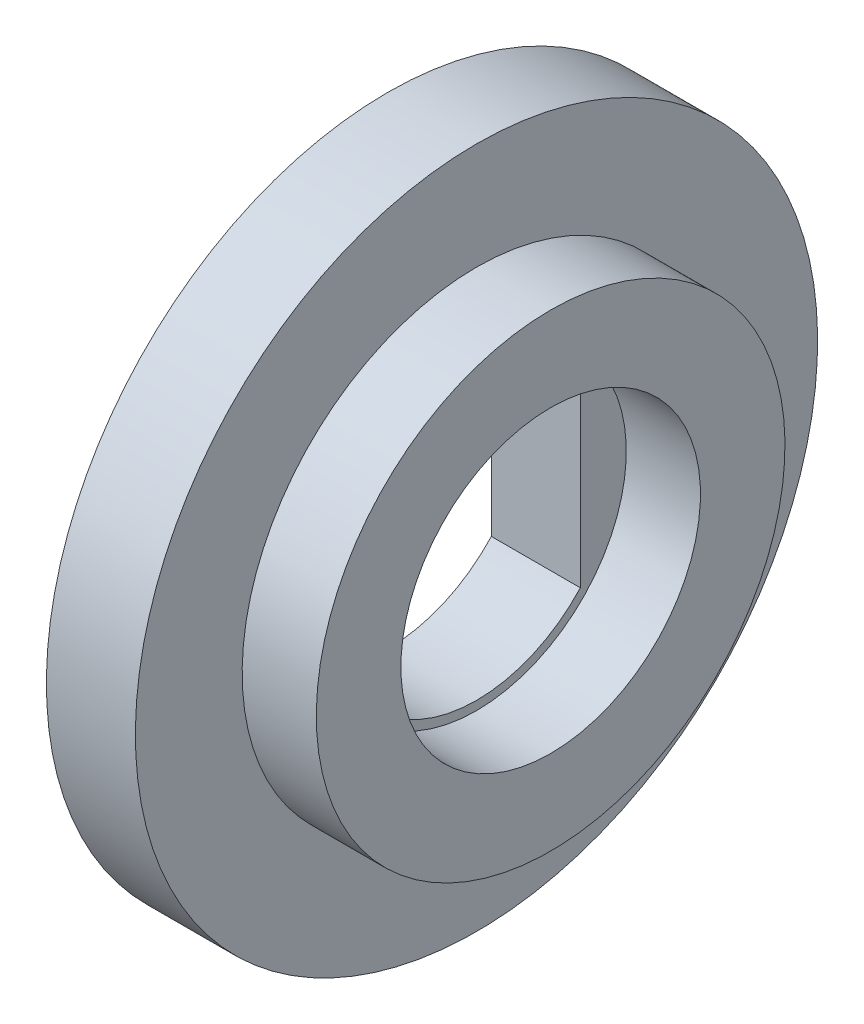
ISO-10303-21;
HEADER;
FILE_DESCRIPTION(('STEP AP214'),'2;1');
FILE_NAME('part.step','',(''),(''),'','','');
FILE_SCHEMA(('AUTOMOTIVE_DESIGN { 1 0 10303 214 1 1 1 1 }'));
ENDSEC;
DATA;
#1=APPLICATION_CONTEXT('core data for automotive mechanical design processes');
#2=APPLICATION_PROTOCOL_DEFINITION('international standard','automotive_design',2000,#1);
#3=PRODUCT_CONTEXT('',#1,'mechanical');
#4=PRODUCT('Part','Part','',(#3));
#5=PRODUCT_RELATED_PRODUCT_CATEGORY('part','',(#4));
#6=PRODUCT_DEFINITION_FORMATION('','',#4);
#7=PRODUCT_DEFINITION_CONTEXT('part definition',#1,'design');
#8=PRODUCT_DEFINITION('design','',#6,#7);
#9=PRODUCT_DEFINITION_SHAPE('','',#8);
#10=(LENGTH_UNIT() NAMED_UNIT(*) SI_UNIT(.MILLI.,.METRE.));
#11=(NAMED_UNIT(*) PLANE_ANGLE_UNIT() SI_UNIT($,.RADIAN.));
#12=(NAMED_UNIT(*) SI_UNIT($,.STERADIAN.) SOLID_ANGLE_UNIT());
#13=UNCERTAINTY_MEASURE_WITH_UNIT(LENGTH_MEASURE(1.E-05),#10,'distance_accuracy_value','');
#14=(GEOMETRIC_REPRESENTATION_CONTEXT(3) GLOBAL_UNCERTAINTY_ASSIGNED_CONTEXT((#13)) GLOBAL_UNIT_ASSIGNED_CONTEXT((#10,
#11,#12)) REPRESENTATION_CONTEXT('',''));
#15=CARTESIAN_POINT('',(0.,0.,0.));
#16=DIRECTION('',(0.,0.,1.));
#17=DIRECTION('',(1.,0.,0.));
#18=AXIS2_PLACEMENT_3D('',#15,#16,#17);
#19=CARTESIAN_POINT('',(3.,0.,0.));
#20=DIRECTION('',(1.,0.,0.));
#21=DIRECTION('',(0.,1.,0.));
#22=AXIS2_PLACEMENT_3D('',#19,#20,#21);
#23=PLANE('',#22);
#24=CARTESIAN_POINT('',(3.,0.,0.));
#25=DIRECTION('',(1.,0.,0.));
#26=DIRECTION('',(0.,1.,0.));
#27=AXIS2_PLACEMENT_3D('',#24,#25,#26);
#28=CIRCLE('',#27,4.75);
#29=CARTESIAN_POINT('',(3.,-3.21130814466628,3.5));
#30=VERTEX_POINT('',#29);
#31=CARTESIAN_POINT('',(3.,-3.21130814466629,-3.5));
#32=VERTEX_POINT('',#31);
#33=EDGE_CURVE('E102',#30,#32,#28,.T.);
#34=ORIENTED_EDGE('',*,*,#33,.F.);
#35=DIRECTION('',(0.,-1.,0.));
#36=VECTOR('',#35,1.);
#37=CARTESIAN_POINT('',(3.,0.,3.5));
#38=LINE('',#37,#36);
#39=CARTESIAN_POINT('',(3.,3.21130814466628,3.5));
#40=VERTEX_POINT('',#39);
#41=EDGE_CURVE('E95',#40,#30,#38,.T.);
#42=ORIENTED_EDGE('',*,*,#41,.F.);
#43=CARTESIAN_POINT('',(3.,0.,0.));
#44=DIRECTION('',(1.,0.,0.));
#45=DIRECTION('',(0.,1.,0.));
#46=AXIS2_PLACEMENT_3D('',#43,#44,#45);
#47=CIRCLE('',#46,4.75);
#48=CARTESIAN_POINT('',(3.,3.21130814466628,-3.5));
#49=VERTEX_POINT('',#48);
#50=EDGE_CURVE('E75',#49,#40,#47,.T.);
#51=ORIENTED_EDGE('',*,*,#50,.F.);
#52=DIRECTION('',(0.,1.,0.));
#53=VECTOR('',#52,1.);
#54=CARTESIAN_POINT('',(3.,0.,-3.5));
#55=LINE('',#54,#53);
#56=EDGE_CURVE('E100',#32,#49,#55,.T.);
#57=ORIENTED_EDGE('',*,*,#56,.F.);
#58=EDGE_LOOP('',(#34,#42,#51,#57));
#59=FACE_BOUND('',#58,.T.);
#60=CARTESIAN_POINT('',(3.,0.,0.));
#61=DIRECTION('',(1.,0.,0.));
#62=DIRECTION('',(0.,1.,0.));
#63=AXIS2_PLACEMENT_3D('',#60,#61,#62);
#64=CIRCLE('',#63,5.05);
#65=CARTESIAN_POINT('',(3.,5.05,0.));
#66=VERTEX_POINT('',#65);
#67=EDGE_CURVE('E11',#66,#66,#64,.T.);
#68=ORIENTED_EDGE('',*,*,#67,.T.);
#69=EDGE_LOOP('',(#68));
#70=FACE_BOUND('',#69,.T.);
#71=ADVANCED_FACE('F29',(#59,#70),#23,.T.);
#72=CARTESIAN_POINT('',(11.25704788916,0.,0.));
#73=DIRECTION('',(1.,0.,0.));
#74=DIRECTION('',(0.,1.,0.));
#75=AXIS2_PLACEMENT_3D('',#72,#73,#74);
#76=CYLINDRICAL_SURFACE('',#75,5.05);
#77=CARTESIAN_POINT('',(5.5,0.,0.));
#78=DIRECTION('',(1.,0.,0.));
#79=DIRECTION('',(0.,1.,0.));
#80=AXIS2_PLACEMENT_3D('',#77,#78,#79);
#81=CIRCLE('',#80,5.05);
#82=CARTESIAN_POINT('',(5.5,5.05,0.));
#83=VERTEX_POINT('',#82);
#84=EDGE_CURVE('E36',#83,#83,#81,.T.);
#85=ORIENTED_EDGE('',*,*,#84,.T.);
#86=EDGE_LOOP('',(#85));
#87=FACE_BOUND('',#86,.T.);
#88=ORIENTED_EDGE('',*,*,#67,.F.);
#89=EDGE_LOOP('',(#88));
#90=FACE_BOUND('',#89,.T.);
#91=ADVANCED_FACE('F130',(#87,#90),#76,.F.);
#92=CARTESIAN_POINT('',(5.5,7.9,0.));
#93=DIRECTION('',(1.,0.,0.));
#94=DIRECTION('',(0.,1.,0.));
#95=AXIS2_PLACEMENT_3D('',#92,#93,#94);
#96=PLANE('',#95);
#97=CARTESIAN_POINT('',(5.5,0.,0.));
#98=DIRECTION('',(1.,0.,0.));
#99=DIRECTION('',(0.,1.,0.));
#100=AXIS2_PLACEMENT_3D('',#97,#98,#99);
#101=CIRCLE('',#100,7.9);
#102=CARTESIAN_POINT('',(5.5,7.9,0.));
#103=VERTEX_POINT('',#102);
#104=EDGE_CURVE('E125',#103,#103,#101,.T.);
#105=ORIENTED_EDGE('',*,*,#104,.T.);
#106=EDGE_LOOP('',(#105));
#107=FACE_BOUND('',#106,.T.);
#108=ORIENTED_EDGE('',*,*,#84,.F.);
#109=EDGE_LOOP('',(#108));
#110=FACE_BOUND('',#109,.T.);
#111=ADVANCED_FACE('F133',(#107,#110),#96,.T.);
#112=CARTESIAN_POINT('',(11.25704788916,0.,0.));
#113=DIRECTION('',(1.,0.,0.));
#114=DIRECTION('',(0.,1.,0.));
#115=AXIS2_PLACEMENT_3D('',#112,#113,#114);
#116=CYLINDRICAL_SURFACE('',#115,7.9);
#117=CARTESIAN_POINT('',(3.,0.,0.));
#118=DIRECTION('',(1.,0.,0.));
#119=DIRECTION('',(0.,1.,0.));
#120=AXIS2_PLACEMENT_3D('',#117,#118,#119);
#121=CIRCLE('',#120,7.9);
#122=CARTESIAN_POINT('',(3.,7.9,0.));
#123=VERTEX_POINT('',#122);
#124=EDGE_CURVE('E122',#123,#123,#121,.T.);
#125=ORIENTED_EDGE('',*,*,#124,.T.);
#126=EDGE_LOOP('',(#125));
#127=FACE_BOUND('',#126,.T.);
#128=ORIENTED_EDGE('',*,*,#104,.F.);
#129=EDGE_LOOP('',(#128));
#130=FACE_BOUND('',#129,.T.);
#131=ADVANCED_FACE('F135',(#127,#130),#116,.T.);
#132=CARTESIAN_POINT('',(3.,11.5,0.));
#133=DIRECTION('',(1.,0.,0.));
#134=DIRECTION('',(0.,1.,0.));
#135=AXIS2_PLACEMENT_3D('',#132,#133,#134);
#136=PLANE('',#135);
#137=CARTESIAN_POINT('',(3.,0.,0.));
#138=DIRECTION('',(1.,0.,0.));
#139=DIRECTION('',(0.,1.,0.));
#140=AXIS2_PLACEMENT_3D('',#137,#138,#139);
#141=CIRCLE('',#140,11.5);
#142=CARTESIAN_POINT('',(3.,11.5,0.));
#143=VERTEX_POINT('',#142);
#144=EDGE_CURVE('E119',#143,#143,#141,.T.);
#145=ORIENTED_EDGE('',*,*,#144,.T.);
#146=EDGE_LOOP('',(#145));
#147=FACE_BOUND('',#146,.T.);
#148=ORIENTED_EDGE('',*,*,#124,.F.);
#149=EDGE_LOOP('',(#148));
#150=FACE_BOUND('',#149,.T.);
#151=ADVANCED_FACE('F142',(#147,#150),#136,.T.);
#152=CARTESIAN_POINT('',(11.25704788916,0.,0.));
#153=DIRECTION('',(1.,0.,0.));
#154=DIRECTION('',(0.,1.,0.));
#155=AXIS2_PLACEMENT_3D('',#152,#153,#154);
#156=CYLINDRICAL_SURFACE('',#155,11.5);
#157=CARTESIAN_POINT('',(0.,0.,0.));
#158=DIRECTION('',(1.,0.,0.));
#159=DIRECTION('',(0.,1.,0.));
#160=AXIS2_PLACEMENT_3D('',#157,#158,#159);
#161=CIRCLE('',#160,11.5);
#162=CARTESIAN_POINT('',(0.,11.5,0.));
#163=VERTEX_POINT('',#162);
#164=EDGE_CURVE('E116',#163,#163,#161,.T.);
#165=ORIENTED_EDGE('',*,*,#164,.T.);
#166=EDGE_LOOP('',(#165));
#167=FACE_BOUND('',#166,.T.);
#168=ORIENTED_EDGE('',*,*,#144,.F.);
#169=EDGE_LOOP('',(#168));
#170=FACE_BOUND('',#169,.T.);
#171=ADVANCED_FACE('F185',(#167,#170),#156,.T.);
#172=CARTESIAN_POINT('',(0.,9.51794919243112,0.));
#173=DIRECTION('',(-1.,0.,0.));
#174=DIRECTION('',(0.,-1.,0.));
#175=AXIS2_PLACEMENT_3D('',#172,#173,#174);
#176=PLANE('',#175);
#177=CARTESIAN_POINT('',(0.,0.,0.));
#178=DIRECTION('',(1.,0.,0.));
#179=DIRECTION('',(0.,1.,0.));
#180=AXIS2_PLACEMENT_3D('',#177,#178,#179);
#181=CIRCLE('',#180,9.51794919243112);
#182=CARTESIAN_POINT('',(0.,9.51794919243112,0.));
#183=VERTEX_POINT('',#182);
#184=EDGE_CURVE('E113',#183,#183,#181,.T.);
#185=ORIENTED_EDGE('',*,*,#184,.T.);
#186=EDGE_LOOP('',(#185));
#187=FACE_BOUND('',#186,.T.);
#188=ORIENTED_EDGE('',*,*,#164,.F.);
#189=EDGE_LOOP('',(#188));
#190=FACE_BOUND('',#189,.T.);
#191=ADVANCED_FACE('F181',(#187,#190),#176,.T.);
#192=CARTESIAN_POINT('',(0.,0.,0.));
#193=DIRECTION('',(-1.,0.,0.));
#194=DIRECTION('',(0.,-1.,0.));
#195=AXIS2_PLACEMENT_3D('',#192,#193,#194);
#196=CONICAL_SURFACE('',#195,9.51794919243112,0.261799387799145);
#197=CARTESIAN_POINT('',(1.,0.,0.));
#198=DIRECTION('',(1.,0.,0.));
#199=DIRECTION('',(0.,1.,0.));
#200=AXIS2_PLACEMENT_3D('',#197,#198,#199);
#201=CIRCLE('',#200,9.25);
#202=CARTESIAN_POINT('',(1.,9.25,0.));
#203=VERTEX_POINT('',#202);
#204=EDGE_CURVE('E110',#203,#203,#201,.T.);
#205=ORIENTED_EDGE('',*,*,#204,.T.);
#206=EDGE_LOOP('',(#205));
#207=FACE_BOUND('',#206,.T.);
#208=ORIENTED_EDGE('',*,*,#184,.F.);
#209=EDGE_LOOP('',(#208));
#210=FACE_BOUND('',#209,.T.);
#211=ADVANCED_FACE('F177',(#207,#210),#196,.F.);
#212=CARTESIAN_POINT('',(1.,5.85,0.));
#213=DIRECTION('',(-1.,0.,0.));
#214=DIRECTION('',(0.,-1.,0.));
#215=AXIS2_PLACEMENT_3D('',#212,#213,#214);
#216=PLANE('',#215);
#217=CARTESIAN_POINT('',(1.,0.,0.));
#218=DIRECTION('',(1.,0.,0.));
#219=DIRECTION('',(0.,1.,0.));
#220=AXIS2_PLACEMENT_3D('',#217,#218,#219);
#221=CIRCLE('',#220,5.85);
#222=CARTESIAN_POINT('',(1.,5.85,0.));
#223=VERTEX_POINT('',#222);
#224=EDGE_CURVE('E107',#223,#223,#221,.T.);
#225=ORIENTED_EDGE('',*,*,#224,.T.);
#226=EDGE_LOOP('',(#225));
#227=FACE_BOUND('',#226,.T.);
#228=ORIENTED_EDGE('',*,*,#204,.F.);
#229=EDGE_LOOP('',(#228));
#230=FACE_BOUND('',#229,.T.);
#231=ADVANCED_FACE('F173',(#227,#230),#216,.T.);
#232=CARTESIAN_POINT('',(11.25704788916,0.,0.));
#233=DIRECTION('',(1.,0.,0.));
#234=DIRECTION('',(0.,1.,0.));
#235=AXIS2_PLACEMENT_3D('',#232,#233,#234);
#236=CYLINDRICAL_SURFACE('',#235,5.85);
#237=CARTESIAN_POINT('',(0.,0.,0.));
#238=DIRECTION('',(1.,0.,0.));
#239=DIRECTION('',(0.,1.,0.));
#240=AXIS2_PLACEMENT_3D('',#237,#238,#239);
#241=CIRCLE('',#240,5.85);
#242=CARTESIAN_POINT('',(0.,5.85,0.));
#243=VERTEX_POINT('',#242);
#244=EDGE_CURVE('E104',#243,#243,#241,.T.);
#245=ORIENTED_EDGE('',*,*,#244,.T.);
#246=EDGE_LOOP('',(#245));
#247=FACE_BOUND('',#246,.T.);
#248=ORIENTED_EDGE('',*,*,#224,.F.);
#249=EDGE_LOOP('',(#248));
#250=FACE_BOUND('',#249,.T.);
#251=ADVANCED_FACE('F170',(#247,#250),#236,.T.);
#252=CARTESIAN_POINT('',(0.,0.,0.));
#253=DIRECTION('',(-1.,0.,0.));
#254=DIRECTION('',(0.,-1.,0.));
#255=AXIS2_PLACEMENT_3D('',#252,#253,#254);
#256=PLANE('',#255);
#257=CARTESIAN_POINT('',(0.,0.,0.));
#258=DIRECTION('',(-1.,0.,0.));
#259=DIRECTION('',(0.,-1.,0.));
#260=AXIS2_PLACEMENT_3D('',#257,#258,#259);
#261=CIRCLE('',#260,4.75);
#262=CARTESIAN_POINT('',(0.,-3.21130814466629,-3.5));
#263=VERTEX_POINT('',#262);
#264=CARTESIAN_POINT('',(0.,-3.21130814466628,3.5));
#265=VERTEX_POINT('',#264);
#266=EDGE_CURVE('E51',#263,#265,#261,.T.);
#267=ORIENTED_EDGE('',*,*,#266,.F.);
#268=DIRECTION('',(0.,-1.,0.));
#269=VECTOR('',#268,1.);
#270=CARTESIAN_POINT('',(0.,-3.21130814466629,-3.5));
#271=LINE('',#270,#269);
#272=CARTESIAN_POINT('',(0.,3.21130814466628,-3.5));
#273=VERTEX_POINT('',#272);
#274=EDGE_CURVE('E88',#273,#263,#271,.T.);
#275=ORIENTED_EDGE('',*,*,#274,.F.);
#276=CARTESIAN_POINT('',(0.,0.,0.));
#277=DIRECTION('',(-1.,0.,0.));
#278=DIRECTION('',(0.,-1.,0.));
#279=AXIS2_PLACEMENT_3D('',#276,#277,#278);
#280=CIRCLE('',#279,4.75);
#281=CARTESIAN_POINT('',(0.,3.21130814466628,3.5));
#282=VERTEX_POINT('',#281);
#283=EDGE_CURVE('E72',#282,#273,#280,.T.);
#284=ORIENTED_EDGE('',*,*,#283,.F.);
#285=DIRECTION('',(0.,1.,0.));
#286=VECTOR('',#285,1.);
#287=CARTESIAN_POINT('',(0.,-3.21130814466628,3.5));
#288=LINE('',#287,#286);
#289=EDGE_CURVE('E81',#265,#282,#288,.T.);
#290=ORIENTED_EDGE('',*,*,#289,.F.);
#291=EDGE_LOOP('',(#267,#275,#284,#290));
#292=FACE_BOUND('',#291,.T.);
#293=ORIENTED_EDGE('',*,*,#244,.F.);
#294=EDGE_LOOP('',(#293));
#295=FACE_BOUND('',#294,.T.);
#296=ADVANCED_FACE('F85',(#292,#295),#256,.T.);
#297=CARTESIAN_POINT('',(5.5,0.,0.));
#298=DIRECTION('',(-1.,0.,0.));
#299=DIRECTION('',(0.,-1.,0.));
#300=AXIS2_PLACEMENT_3D('',#297,#298,#299);
#301=CYLINDRICAL_SURFACE('',#300,4.75);
#302=ORIENTED_EDGE('',*,*,#33,.T.);
#303=DIRECTION('',(-1.,0.,0.));
#304=VECTOR('',#303,1.);
#305=CARTESIAN_POINT('',(5.5,-3.21130814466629,-3.5));
#306=LINE('',#305,#304);
#307=EDGE_CURVE('E93',#32,#263,#306,.T.);
#308=ORIENTED_EDGE('',*,*,#307,.T.);
#309=ORIENTED_EDGE('',*,*,#266,.T.);
#310=DIRECTION('',(-1.,0.,0.));
#311=VECTOR('',#310,1.);
#312=CARTESIAN_POINT('',(5.5,-3.21130814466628,3.5));
#313=LINE('',#312,#311);
#314=EDGE_CURVE('E78',#30,#265,#313,.T.);
#315=ORIENTED_EDGE('',*,*,#314,.F.);
#316=EDGE_LOOP('',(#302,#308,#309,#315));
#317=FACE_BOUND('',#316,.T.);
#318=ADVANCED_FACE('F154',(#317),#301,.F.);
#319=CARTESIAN_POINT('',(5.5,-3.21130814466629,-3.5));
#320=DIRECTION('',(0.,0.,-1.));
#321=DIRECTION('',(-1.,0.,0.));
#322=AXIS2_PLACEMENT_3D('',#319,#320,#321);
#323=PLANE('',#322);
#324=ORIENTED_EDGE('',*,*,#56,.T.);
#325=DIRECTION('',(-1.,0.,0.));
#326=VECTOR('',#325,1.);
#327=CARTESIAN_POINT('',(5.5,3.21130814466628,-3.5));
#328=LINE('',#327,#326);
#329=EDGE_CURVE('E77',#49,#273,#328,.T.);
#330=ORIENTED_EDGE('',*,*,#329,.T.);
#331=ORIENTED_EDGE('',*,*,#274,.T.);
#332=ORIENTED_EDGE('',*,*,#307,.F.);
#333=EDGE_LOOP('',(#324,#330,#331,#332));
#334=FACE_BOUND('',#333,.T.);
#335=ADVANCED_FACE('F156',(#334),#323,.F.);
#336=CARTESIAN_POINT('',(5.5,0.,0.));
#337=DIRECTION('',(-1.,0.,0.));
#338=DIRECTION('',(0.,-1.,0.));
#339=AXIS2_PLACEMENT_3D('',#336,#337,#338);
#340=CYLINDRICAL_SURFACE('',#339,4.75);
#341=ORIENTED_EDGE('',*,*,#50,.T.);
#342=DIRECTION('',(-1.,0.,0.));
#343=VECTOR('',#342,1.);
#344=CARTESIAN_POINT('',(5.5,3.21130814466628,3.5));
#345=LINE('',#344,#343);
#346=EDGE_CURVE('E43',#40,#282,#345,.T.);
#347=ORIENTED_EDGE('',*,*,#346,.T.);
#348=ORIENTED_EDGE('',*,*,#283,.T.);
#349=ORIENTED_EDGE('',*,*,#329,.F.);
#350=EDGE_LOOP('',(#341,#347,#348,#349));
#351=FACE_BOUND('',#350,.T.);
#352=ADVANCED_FACE('F69',(#351),#340,.F.);
#353=CARTESIAN_POINT('',(5.5,-3.21130814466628,3.5));
#354=DIRECTION('',(0.,0.,1.));
#355=DIRECTION('',(1.,0.,0.));
#356=AXIS2_PLACEMENT_3D('',#353,#354,#355);
#357=PLANE('',#356);
#358=ORIENTED_EDGE('',*,*,#41,.T.);
#359=ORIENTED_EDGE('',*,*,#314,.T.);
#360=ORIENTED_EDGE('',*,*,#289,.T.);
#361=ORIENTED_EDGE('',*,*,#346,.F.);
#362=EDGE_LOOP('',(#358,#359,#360,#361));
#363=FACE_BOUND('',#362,.T.);
#364=ADVANCED_FACE('F82',(#363),#357,.F.);
#365=CLOSED_SHELL('',(#71,#91,#111,#131,#151,#171,#191,#211,#231,#251,#296,#318,#335,#352,#364));
#366=MANIFOLD_SOLID_BREP('B2',#365);
#367=ADVANCED_BREP_SHAPE_REPRESENTATION('',(#18,#366),#14);
#368=SHAPE_DEFINITION_REPRESENTATION(#9,#367);
ENDSEC;
END-ISO-10303-21;
